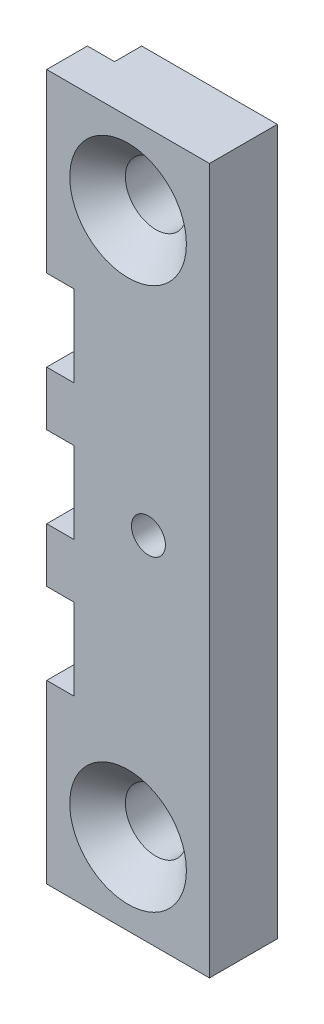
ISO-10303-21;
HEADER;
FILE_DESCRIPTION(('STEP AP214'),'2;1');
FILE_NAME('part.step','',(''),(''),'','','');
FILE_SCHEMA(('AUTOMOTIVE_DESIGN { 1 0 10303 214 1 1 1 1 }'));
ENDSEC;
DATA;
#1=APPLICATION_CONTEXT('core data for automotive mechanical design processes');
#2=APPLICATION_PROTOCOL_DEFINITION('international standard','automotive_design',2000,#1);
#3=PRODUCT_CONTEXT('',#1,'mechanical');
#4=PRODUCT('Part','Part','',(#3));
#5=PRODUCT_RELATED_PRODUCT_CATEGORY('part','',(#4));
#6=PRODUCT_DEFINITION_FORMATION('','',#4);
#7=PRODUCT_DEFINITION_CONTEXT('part definition',#1,'design');
#8=PRODUCT_DEFINITION('design','',#6,#7);
#9=PRODUCT_DEFINITION_SHAPE('','',#8);
#10=(LENGTH_UNIT() NAMED_UNIT(*) SI_UNIT(.MILLI.,.METRE.));
#11=(NAMED_UNIT(*) PLANE_ANGLE_UNIT() SI_UNIT($,.RADIAN.));
#12=(NAMED_UNIT(*) SI_UNIT($,.STERADIAN.) SOLID_ANGLE_UNIT());
#13=UNCERTAINTY_MEASURE_WITH_UNIT(LENGTH_MEASURE(1.E-05),#10,'distance_accuracy_value','');
#14=(GEOMETRIC_REPRESENTATION_CONTEXT(3) GLOBAL_UNCERTAINTY_ASSIGNED_CONTEXT((#13)) GLOBAL_UNIT_ASSIGNED_CONTEXT((#10,
#11,#12)) REPRESENTATION_CONTEXT('',''));
#15=CARTESIAN_POINT('',(0.,0.,0.));
#16=DIRECTION('',(0.,0.,1.));
#17=DIRECTION('',(1.,0.,0.));
#18=AXIS2_PLACEMENT_3D('',#15,#16,#17);
#19=CARTESIAN_POINT('',(0.,0.,5.));
#20=DIRECTION('',(0.,0.,-1.));
#21=DIRECTION('',(-1.,0.,0.));
#22=AXIS2_PLACEMENT_3D('',#19,#20,#21);
#23=PLANE('',#22);
#24=DIRECTION('',(0.,-1.,0.));
#25=VECTOR('',#24,1.);
#26=CARTESIAN_POINT('',(-112.,34.802471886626,5.));
#27=LINE('',#26,#25);
#28=CARTESIAN_POINT('',(-112.,15.802471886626,5.));
#29=VERTEX_POINT('',#28);
#30=CARTESIAN_POINT('',(-112.,11.802471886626,5.));
#31=VERTEX_POINT('',#30);
#32=EDGE_CURVE('E184',#29,#31,#27,.T.);
#33=ORIENTED_EDGE('',*,*,#32,.T.);
#34=DIRECTION('',(1.,0.,0.));
#35=VECTOR('',#34,1.);
#36=CARTESIAN_POINT('',(-114.,11.802471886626,5.));
#37=LINE('',#36,#35);
#38=CARTESIAN_POINT('',(-110.,11.802471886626,5.));
#39=VERTEX_POINT('',#38);
#40=EDGE_CURVE('E259',#31,#39,#37,.T.);
#41=ORIENTED_EDGE('',*,*,#40,.T.);
#42=DIRECTION('',(0.,-1.,0.));
#43=VECTOR('',#42,1.);
#44=CARTESIAN_POINT('',(-110.,11.802471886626,5.));
#45=LINE('',#44,#43);
#46=CARTESIAN_POINT('',(-110.,5.80247188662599,5.));
#47=VERTEX_POINT('',#46);
#48=EDGE_CURVE('E267',#39,#47,#45,.T.);
#49=ORIENTED_EDGE('',*,*,#48,.T.);
#50=DIRECTION('',(-1.,0.,0.));
#51=VECTOR('',#50,1.);
#52=CARTESIAN_POINT('',(-114.,5.80247188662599,5.));
#53=LINE('',#52,#51);
#54=CARTESIAN_POINT('',(-112.,5.80247188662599,5.));
#55=VERTEX_POINT('',#54);
#56=EDGE_CURVE('E264',#47,#55,#53,.T.);
#57=ORIENTED_EDGE('',*,*,#56,.T.);
#58=CARTESIAN_POINT('',(-112.,1.80247188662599,5.));
#59=VERTEX_POINT('',#58);
#60=EDGE_CURVE('E185',#55,#59,#27,.T.);
#61=ORIENTED_EDGE('',*,*,#60,.T.);
#62=DIRECTION('',(1.,0.,0.));
#63=VECTOR('',#62,1.);
#64=CARTESIAN_POINT('',(-112.,1.80247188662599,5.));
#65=LINE('',#64,#63);
#66=CARTESIAN_POINT('',(-110.,1.80247188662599,5.));
#67=VERTEX_POINT('',#66);
#68=EDGE_CURVE('E221',#59,#67,#65,.T.);
#69=ORIENTED_EDGE('',*,*,#68,.T.);
#70=DIRECTION('',(0.,-1.,0.));
#71=VECTOR('',#70,1.);
#72=CARTESIAN_POINT('',(-110.,-4.19752811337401,5.));
#73=LINE('',#72,#71);
#74=CARTESIAN_POINT('',(-110.,-4.19752811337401,5.));
#75=VERTEX_POINT('',#74);
#76=EDGE_CURVE('E225',#67,#75,#73,.T.);
#77=ORIENTED_EDGE('',*,*,#76,.T.);
#78=DIRECTION('',(-1.,0.,0.));
#79=VECTOR('',#78,1.);
#80=CARTESIAN_POINT('',(-112.,-4.19752811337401,5.));
#81=LINE('',#80,#79);
#82=CARTESIAN_POINT('',(-112.,-4.19752811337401,5.));
#83=VERTEX_POINT('',#82);
#84=EDGE_CURVE('E212',#75,#83,#81,.T.);
#85=ORIENTED_EDGE('',*,*,#84,.T.);
#86=CARTESIAN_POINT('',(-112.,-17.197528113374,5.));
#87=VERTEX_POINT('',#86);
#88=EDGE_CURVE('E186',#83,#87,#27,.T.);
#89=ORIENTED_EDGE('',*,*,#88,.T.);
#90=DIRECTION('',(1.,0.,0.));
#91=VECTOR('',#90,1.);
#92=CARTESIAN_POINT('',(-100.,-17.197528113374,5.));
#93=LINE('',#92,#91);
#94=CARTESIAN_POINT('',(-100.,-17.197528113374,5.));
#95=VERTEX_POINT('',#94);
#96=EDGE_CURVE('E163',#87,#95,#93,.T.);
#97=ORIENTED_EDGE('',*,*,#96,.T.);
#98=DIRECTION('',(0.,1.,0.));
#99=VECTOR('',#98,1.);
#100=CARTESIAN_POINT('',(-100.,34.802471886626,5.));
#101=LINE('',#100,#99);
#102=CARTESIAN_POINT('',(-100.,34.802471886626,5.));
#103=VERTEX_POINT('',#102);
#104=EDGE_CURVE('E172',#95,#103,#101,.T.);
#105=ORIENTED_EDGE('',*,*,#104,.T.);
#106=DIRECTION('',(-1.,0.,0.));
#107=VECTOR('',#106,1.);
#108=CARTESIAN_POINT('',(-100.,34.802471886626,5.));
#109=LINE('',#108,#107);
#110=CARTESIAN_POINT('',(-112.,34.802471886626,5.));
#111=VERTEX_POINT('',#110);
#112=EDGE_CURVE('E187',#103,#111,#109,.T.);
#113=ORIENTED_EDGE('',*,*,#112,.T.);
#114=CARTESIAN_POINT('',(-112.,21.802471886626,5.));
#115=VERTEX_POINT('',#114);
#116=EDGE_CURVE('E181',#111,#115,#27,.T.);
#117=ORIENTED_EDGE('',*,*,#116,.T.);
#118=DIRECTION('',(1.,0.,0.));
#119=VECTOR('',#118,1.);
#120=CARTESIAN_POINT('',(-112.,21.802471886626,5.));
#121=LINE('',#120,#119);
#122=CARTESIAN_POINT('',(-110.,21.802471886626,5.));
#123=VERTEX_POINT('',#122);
#124=EDGE_CURVE('E247',#115,#123,#121,.T.);
#125=ORIENTED_EDGE('',*,*,#124,.T.);
#126=DIRECTION('',(0.,-1.,0.));
#127=VECTOR('',#126,1.);
#128=CARTESIAN_POINT('',(-110.,21.802471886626,5.));
#129=LINE('',#128,#127);
#130=CARTESIAN_POINT('',(-110.,15.802471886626,5.));
#131=VERTEX_POINT('',#130);
#132=EDGE_CURVE('E244',#123,#131,#129,.T.);
#133=ORIENTED_EDGE('',*,*,#132,.T.);
#134=DIRECTION('',(-1.,0.,0.));
#135=VECTOR('',#134,1.);
#136=CARTESIAN_POINT('',(-112.,15.802471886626,5.));
#137=LINE('',#136,#135);
#138=EDGE_CURVE('E234',#131,#29,#137,.T.);
#139=ORIENTED_EDGE('',*,*,#138,.T.);
#140=EDGE_LOOP('',(#33,#41,#49,#57,#61,#69,#77,#85,#89,#97,#105,#113,#117,#125,#133,#139));
#141=FACE_BOUND('',#140,.T.);
#142=CARTESIAN_POINT('',(-106.,28.802471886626,5.));
#143=DIRECTION('',(0.,0.,1.));
#144=DIRECTION('',(1.,0.,0.));
#145=AXIS2_PLACEMENT_3D('',#142,#143,#144);
#146=CIRCLE('',#145,4.3);
#147=CARTESIAN_POINT('',(-101.7,28.802471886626,5.));
#148=VERTEX_POINT('',#147);
#149=EDGE_CURVE('E205',#148,#148,#146,.T.);
#150=ORIENTED_EDGE('',*,*,#149,.F.);
#151=EDGE_LOOP('',(#150));
#152=FACE_BOUND('',#151,.T.);
#153=CARTESIAN_POINT('',(-106.,-11.197528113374,5.));
#154=DIRECTION('',(0.,0.,1.));
#155=DIRECTION('',(1.,0.,0.));
#156=AXIS2_PLACEMENT_3D('',#153,#154,#155);
#157=CIRCLE('',#156,4.3);
#158=CARTESIAN_POINT('',(-101.7,-11.197528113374,5.));
#159=VERTEX_POINT('',#158);
#160=EDGE_CURVE('E196',#159,#159,#157,.T.);
#161=ORIENTED_EDGE('',*,*,#160,.F.);
#162=EDGE_LOOP('',(#161));
#163=FACE_BOUND('',#162,.T.);
#164=CARTESIAN_POINT('',(-104.5,8.80247188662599,5.));
#165=DIRECTION('',(0.,0.,1.));
#166=DIRECTION('',(1.,0.,0.));
#167=AXIS2_PLACEMENT_3D('',#164,#165,#166);
#168=CIRCLE('',#167,1.25);
#169=CARTESIAN_POINT('',(-103.25,8.80247188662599,5.));
#170=VERTEX_POINT('',#169);
#171=EDGE_CURVE('E296',#170,#170,#168,.T.);
#172=ORIENTED_EDGE('',*,*,#171,.F.);
#173=EDGE_LOOP('',(#172));
#174=FACE_BOUND('',#173,.T.);
#175=ADVANCED_FACE('F16',(#141,#152,#163,#174),#23,.F.);
#176=CARTESIAN_POINT('',(-112.,34.802471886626,5.));
#177=DIRECTION('',(1.,0.,0.));
#178=DIRECTION('',(0.,0.,-1.));
#179=AXIS2_PLACEMENT_3D('',#176,#177,#178);
#180=PLANE('',#179);
#181=DIRECTION('',(0.,0.,-1.));
#182=VECTOR('',#181,1.);
#183=CARTESIAN_POINT('',(-112.,15.802471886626,5.));
#184=LINE('',#183,#182);
#185=CARTESIAN_POINT('',(-112.,15.802471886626,2.));
#186=VERTEX_POINT('',#185);
#187=EDGE_CURVE('E237',#29,#186,#184,.T.);
#188=ORIENTED_EDGE('',*,*,#187,.T.);
#189=DIRECTION('',(0.,1.,0.));
#190=VECTOR('',#189,1.);
#191=CARTESIAN_POINT('',(-112.,-17.197528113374,2.));
#192=LINE('',#191,#190);
#193=CARTESIAN_POINT('',(-112.,11.802471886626,2.));
#194=VERTEX_POINT('',#193);
#195=EDGE_CURVE('E367',#194,#186,#192,.T.);
#196=ORIENTED_EDGE('',*,*,#195,.F.);
#197=DIRECTION('',(0.,0.,1.));
#198=VECTOR('',#197,1.);
#199=CARTESIAN_POINT('',(-112.,11.802471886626,5.));
#200=LINE('',#199,#198);
#201=EDGE_CURVE('E250',#194,#31,#200,.T.);
#202=ORIENTED_EDGE('',*,*,#201,.T.);
#203=ORIENTED_EDGE('',*,*,#32,.F.);
#204=EDGE_LOOP('',(#188,#196,#202,#203));
#205=FACE_BOUND('',#204,.T.);
#206=ADVANCED_FACE('F303',(#205),#180,.F.);
#207=DIRECTION('',(0.,0.,-1.));
#208=VECTOR('',#207,1.);
#209=CARTESIAN_POINT('',(-112.,34.802471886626,5.));
#210=LINE('',#209,#208);
#211=CARTESIAN_POINT('',(-112.,34.802471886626,2.));
#212=VERTEX_POINT('',#211);
#213=EDGE_CURVE('E24',#111,#212,#210,.T.);
#214=ORIENTED_EDGE('',*,*,#213,.T.);
#215=CARTESIAN_POINT('',(-112.,21.802471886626,2.));
#216=VERTEX_POINT('',#215);
#217=EDGE_CURVE('E160',#216,#212,#192,.T.);
#218=ORIENTED_EDGE('',*,*,#217,.F.);
#219=DIRECTION('',(0.,0.,-1.));
#220=VECTOR('',#219,1.);
#221=CARTESIAN_POINT('',(-112.,21.802471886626,5.));
#222=LINE('',#221,#220);
#223=EDGE_CURVE('E222',#115,#216,#222,.T.);
#224=ORIENTED_EDGE('',*,*,#223,.F.);
#225=ORIENTED_EDGE('',*,*,#116,.F.);
#226=EDGE_LOOP('',(#214,#218,#224,#225));
#227=FACE_BOUND('',#226,.T.);
#228=ADVANCED_FACE('F311',(#227),#180,.F.);
#229=DIRECTION('',(0.,0.,-1.));
#230=VECTOR('',#229,1.);
#231=CARTESIAN_POINT('',(-112.,-4.19752811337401,5.));
#232=LINE('',#231,#230);
#233=CARTESIAN_POINT('',(-112.,-4.19752811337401,2.));
#234=VERTEX_POINT('',#233);
#235=EDGE_CURVE('E157',#83,#234,#232,.T.);
#236=ORIENTED_EDGE('',*,*,#235,.T.);
#237=CARTESIAN_POINT('',(-112.,-17.197528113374,2.));
#238=VERTEX_POINT('',#237);
#239=EDGE_CURVE('E31',#238,#234,#192,.T.);
#240=ORIENTED_EDGE('',*,*,#239,.F.);
#241=DIRECTION('',(0.,0.,-1.));
#242=VECTOR('',#241,1.);
#243=CARTESIAN_POINT('',(-112.,-17.197528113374,5.));
#244=LINE('',#243,#242);
#245=EDGE_CURVE('E155',#87,#238,#244,.T.);
#246=ORIENTED_EDGE('',*,*,#245,.F.);
#247=ORIENTED_EDGE('',*,*,#88,.F.);
#248=EDGE_LOOP('',(#236,#240,#246,#247));
#249=FACE_BOUND('',#248,.T.);
#250=ADVANCED_FACE('F153',(#249),#180,.F.);
#251=CARTESIAN_POINT('',(-100.,34.802471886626,5.));
#252=DIRECTION('',(-1.,0.,0.));
#253=DIRECTION('',(0.,0.,1.));
#254=AXIS2_PLACEMENT_3D('',#251,#252,#253);
#255=PLANE('',#254);
#256=DIRECTION('',(0.,1.,0.));
#257=VECTOR('',#256,1.);
#258=CARTESIAN_POINT('',(-100.,34.802471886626,0.));
#259=LINE('',#258,#257);
#260=CARTESIAN_POINT('',(-100.,-17.197528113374,0.));
#261=VERTEX_POINT('',#260);
#262=CARTESIAN_POINT('',(-100.,34.802471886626,0.));
#263=VERTEX_POINT('',#262);
#264=EDGE_CURVE('E176',#261,#263,#259,.T.);
#265=ORIENTED_EDGE('',*,*,#264,.T.);
#266=DIRECTION('',(0.,0.,-1.));
#267=VECTOR('',#266,1.);
#268=CARTESIAN_POINT('',(-100.,34.802471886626,5.));
#269=LINE('',#268,#267);
#270=EDGE_CURVE('E11',#103,#263,#269,.T.);
#271=ORIENTED_EDGE('',*,*,#270,.F.);
#272=ORIENTED_EDGE('',*,*,#104,.F.);
#273=DIRECTION('',(0.,0.,-1.));
#274=VECTOR('',#273,1.);
#275=CARTESIAN_POINT('',(-100.,-17.197528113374,5.));
#276=LINE('',#275,#274);
#277=EDGE_CURVE('E164',#95,#261,#276,.T.);
#278=ORIENTED_EDGE('',*,*,#277,.T.);
#279=EDGE_LOOP('',(#265,#271,#272,#278));
#280=FACE_BOUND('',#279,.T.);
#281=ADVANCED_FACE('F18',(#280),#255,.F.);
#282=CARTESIAN_POINT('',(-100.,34.802471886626,5.));
#283=DIRECTION('',(0.,-1.,0.));
#284=DIRECTION('',(0.,0.,-1.));
#285=AXIS2_PLACEMENT_3D('',#282,#283,#284);
#286=PLANE('',#285);
#287=DIRECTION('',(-1.,0.,0.));
#288=VECTOR('',#287,1.);
#289=CARTESIAN_POINT('',(-100.,34.802471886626,0.));
#290=LINE('',#289,#288);
#291=CARTESIAN_POINT('',(-110.,34.802471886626,0.));
#292=VERTEX_POINT('',#291);
#293=EDGE_CURVE('E173',#263,#292,#290,.T.);
#294=ORIENTED_EDGE('',*,*,#293,.T.);
#295=DIRECTION('',(0.,0.,-1.));
#296=VECTOR('',#295,1.);
#297=CARTESIAN_POINT('',(-110.,34.802471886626,0.));
#298=LINE('',#297,#296);
#299=CARTESIAN_POINT('',(-110.,34.802471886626,2.));
#300=VERTEX_POINT('',#299);
#301=EDGE_CURVE('E148',#300,#292,#298,.T.);
#302=ORIENTED_EDGE('',*,*,#301,.F.);
#303=DIRECTION('',(1.,0.,0.));
#304=VECTOR('',#303,1.);
#305=CARTESIAN_POINT('',(-112.,34.802471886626,2.));
#306=LINE('',#305,#304);
#307=EDGE_CURVE('E290',#212,#300,#306,.T.);
#308=ORIENTED_EDGE('',*,*,#307,.F.);
#309=ORIENTED_EDGE('',*,*,#213,.F.);
#310=ORIENTED_EDGE('',*,*,#112,.F.);
#311=ORIENTED_EDGE('',*,*,#270,.T.);
#312=EDGE_LOOP('',(#294,#302,#308,#309,#310,#311));
#313=FACE_BOUND('',#312,.T.);
#314=ADVANCED_FACE('F327',(#313),#286,.F.);
#315=DIRECTION('',(0.,0.,-1.));
#316=VECTOR('',#315,1.);
#317=CARTESIAN_POINT('',(-112.,5.802471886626,5.));
#318=LINE('',#317,#316);
#319=CARTESIAN_POINT('',(-112.,5.802471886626,2.));
#320=VERTEX_POINT('',#319);
#321=EDGE_CURVE('E252',#55,#320,#318,.T.);
#322=ORIENTED_EDGE('',*,*,#321,.T.);
#323=CARTESIAN_POINT('',(-112.,1.80247188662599,2.));
#324=VERTEX_POINT('',#323);
#325=EDGE_CURVE('E158',#324,#320,#192,.T.);
#326=ORIENTED_EDGE('',*,*,#325,.F.);
#327=DIRECTION('',(0.,0.,-1.));
#328=VECTOR('',#327,1.);
#329=CARTESIAN_POINT('',(-112.,1.80247188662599,5.));
#330=LINE('',#329,#328);
#331=EDGE_CURVE('E208',#59,#324,#330,.T.);
#332=ORIENTED_EDGE('',*,*,#331,.F.);
#333=ORIENTED_EDGE('',*,*,#60,.F.);
#334=EDGE_LOOP('',(#322,#326,#332,#333));
#335=FACE_BOUND('',#334,.T.);
#336=ADVANCED_FACE('F314',(#335),#180,.F.);
#337=CARTESIAN_POINT('',(-100.,-17.197528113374,5.));
#338=DIRECTION('',(0.,1.,0.));
#339=DIRECTION('',(0.,0.,1.));
#340=AXIS2_PLACEMENT_3D('',#337,#338,#339);
#341=PLANE('',#340);
#342=DIRECTION('',(1.,0.,0.));
#343=VECTOR('',#342,1.);
#344=CARTESIAN_POINT('',(-112.,-17.197528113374,2.));
#345=LINE('',#344,#343);
#346=CARTESIAN_POINT('',(-110.,-17.197528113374,2.));
#347=VERTEX_POINT('',#346);
#348=EDGE_CURVE('E139',#238,#347,#345,.T.);
#349=ORIENTED_EDGE('',*,*,#348,.T.);
#350=DIRECTION('',(0.,0.,-1.));
#351=VECTOR('',#350,1.);
#352=CARTESIAN_POINT('',(-110.,-17.197528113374,0.));
#353=LINE('',#352,#351);
#354=CARTESIAN_POINT('',(-110.,-17.197528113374,0.));
#355=VERTEX_POINT('',#354);
#356=EDGE_CURVE('E147',#347,#355,#353,.T.);
#357=ORIENTED_EDGE('',*,*,#356,.T.);
#358=DIRECTION('',(1.,0.,0.));
#359=VECTOR('',#358,1.);
#360=CARTESIAN_POINT('',(-100.,-17.197528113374,0.));
#361=LINE('',#360,#359);
#362=EDGE_CURVE('E170',#355,#261,#361,.T.);
#363=ORIENTED_EDGE('',*,*,#362,.T.);
#364=ORIENTED_EDGE('',*,*,#277,.F.);
#365=ORIENTED_EDGE('',*,*,#96,.F.);
#366=ORIENTED_EDGE('',*,*,#245,.T.);
#367=EDGE_LOOP('',(#349,#357,#363,#364,#365,#366));
#368=FACE_BOUND('',#367,.T.);
#369=ADVANCED_FACE('F161',(#368),#341,.F.);
#370=CARTESIAN_POINT('',(0.,0.,0.));
#371=DIRECTION('',(0.,0.,-1.));
#372=DIRECTION('',(-1.,0.,0.));
#373=AXIS2_PLACEMENT_3D('',#370,#371,#372);
#374=PLANE('',#373);
#375=CARTESIAN_POINT('',(-104.5,8.80247188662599,0.));
#376=DIRECTION('',(0.,0.,1.));
#377=DIRECTION('',(1.,0.,0.));
#378=AXIS2_PLACEMENT_3D('',#375,#376,#377);
#379=CIRCLE('',#378,1.25);
#380=CARTESIAN_POINT('',(-103.25,8.80247188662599,0.));
#381=VERTEX_POINT('',#380);
#382=EDGE_CURVE('E292',#381,#381,#379,.T.);
#383=ORIENTED_EDGE('',*,*,#382,.T.);
#384=EDGE_LOOP('',(#383));
#385=FACE_BOUND('',#384,.T.);
#386=DIRECTION('',(0.,-1.,0.));
#387=VECTOR('',#386,1.);
#388=CARTESIAN_POINT('',(-110.,-4.19752811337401,0.));
#389=LINE('',#388,#387);
#390=EDGE_CURVE('E219',#292,#355,#389,.T.);
#391=ORIENTED_EDGE('',*,*,#390,.F.);
#392=ORIENTED_EDGE('',*,*,#293,.F.);
#393=ORIENTED_EDGE('',*,*,#264,.F.);
#394=ORIENTED_EDGE('',*,*,#362,.F.);
#395=EDGE_LOOP('',(#391,#392,#393,#394));
#396=FACE_BOUND('',#395,.T.);
#397=CARTESIAN_POINT('',(-106.,28.802471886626,0.));
#398=DIRECTION('',(0.,0.,1.));
#399=DIRECTION('',(1.,0.,0.));
#400=AXIS2_PLACEMENT_3D('',#397,#398,#399);
#401=CIRCLE('',#400,2.25);
#402=CARTESIAN_POINT('',(-103.75,28.802471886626,0.));
#403=VERTEX_POINT('',#402);
#404=EDGE_CURVE('E199',#403,#403,#401,.T.);
#405=ORIENTED_EDGE('',*,*,#404,.T.);
#406=EDGE_LOOP('',(#405));
#407=FACE_BOUND('',#406,.T.);
#408=CARTESIAN_POINT('',(-106.,-11.197528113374,0.));
#409=DIRECTION('',(0.,0.,1.));
#410=DIRECTION('',(1.,0.,0.));
#411=AXIS2_PLACEMENT_3D('',#408,#409,#410);
#412=CIRCLE('',#411,2.25);
#413=CARTESIAN_POINT('',(-103.75,-11.197528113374,0.));
#414=VERTEX_POINT('',#413);
#415=EDGE_CURVE('E179',#414,#414,#412,.T.);
#416=ORIENTED_EDGE('',*,*,#415,.T.);
#417=EDGE_LOOP('',(#416));
#418=FACE_BOUND('',#417,.T.);
#419=ADVANCED_FACE('F321',(#385,#396,#407,#418),#374,.T.);
#420=CARTESIAN_POINT('',(-106.,-11.197528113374,5.));
#421=DIRECTION('',(0.,0.,1.));
#422=DIRECTION('',(1.,0.,0.));
#423=AXIS2_PLACEMENT_3D('',#420,#421,#422);
#424=CYLINDRICAL_SURFACE('',#423,2.25);
#425=ORIENTED_EDGE('',*,*,#415,.F.);
#426=EDGE_LOOP('',(#425));
#427=FACE_BOUND('',#426,.T.);
#428=CARTESIAN_POINT('',(-106.,-11.197528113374,2.95));
#429=DIRECTION('',(0.,0.,1.));
#430=DIRECTION('',(1.,0.,0.));
#431=AXIS2_PLACEMENT_3D('',#428,#429,#430);
#432=CIRCLE('',#431,2.25);
#433=CARTESIAN_POINT('',(-103.75,-11.197528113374,2.95));
#434=VERTEX_POINT('',#433);
#435=EDGE_CURVE('E193',#434,#434,#432,.T.);
#436=ORIENTED_EDGE('',*,*,#435,.T.);
#437=EDGE_LOOP('',(#436));
#438=FACE_BOUND('',#437,.T.);
#439=ADVANCED_FACE('F319',(#427,#438),#424,.F.);
#440=CARTESIAN_POINT('',(-106.,-11.197528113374,5.));
#441=DIRECTION('',(0.,0.,1.));
#442=DIRECTION('',(1.,0.,0.));
#443=AXIS2_PLACEMENT_3D('',#440,#441,#442);
#444=CONICAL_SURFACE('',#443,4.3,0.785398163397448);
#445=ORIENTED_EDGE('',*,*,#435,.F.);
#446=EDGE_LOOP('',(#445));
#447=FACE_BOUND('',#446,.T.);
#448=ORIENTED_EDGE('',*,*,#160,.T.);
#449=EDGE_LOOP('',(#448));
#450=FACE_BOUND('',#449,.T.);
#451=ADVANCED_FACE('F412',(#447,#450),#444,.F.);
#452=CARTESIAN_POINT('',(-106.,28.802471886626,5.));
#453=DIRECTION('',(0.,0.,1.));
#454=DIRECTION('',(1.,0.,0.));
#455=AXIS2_PLACEMENT_3D('',#452,#453,#454);
#456=CYLINDRICAL_SURFACE('',#455,2.25);
#457=ORIENTED_EDGE('',*,*,#404,.F.);
#458=EDGE_LOOP('',(#457));
#459=FACE_BOUND('',#458,.T.);
#460=CARTESIAN_POINT('',(-106.,28.802471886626,2.95));
#461=DIRECTION('',(0.,0.,1.));
#462=DIRECTION('',(1.,0.,0.));
#463=AXIS2_PLACEMENT_3D('',#460,#461,#462);
#464=CIRCLE('',#463,2.25);
#465=CARTESIAN_POINT('',(-103.75,28.802471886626,2.95));
#466=VERTEX_POINT('',#465);
#467=EDGE_CURVE('E202',#466,#466,#464,.T.);
#468=ORIENTED_EDGE('',*,*,#467,.T.);
#469=EDGE_LOOP('',(#468));
#470=FACE_BOUND('',#469,.T.);
#471=ADVANCED_FACE('F409',(#459,#470),#456,.F.);
#472=CARTESIAN_POINT('',(-106.,28.802471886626,5.));
#473=DIRECTION('',(0.,0.,1.));
#474=DIRECTION('',(1.,0.,0.));
#475=AXIS2_PLACEMENT_3D('',#472,#473,#474);
#476=CONICAL_SURFACE('',#475,4.3,0.785398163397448);
#477=ORIENTED_EDGE('',*,*,#467,.F.);
#478=EDGE_LOOP('',(#477));
#479=FACE_BOUND('',#478,.T.);
#480=ORIENTED_EDGE('',*,*,#149,.T.);
#481=EDGE_LOOP('',(#480));
#482=FACE_BOUND('',#481,.T.);
#483=ADVANCED_FACE('F402',(#479,#482),#476,.F.);
#484=CARTESIAN_POINT('',(-112.,-4.19752811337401,5.));
#485=DIRECTION('',(0.,-1.,0.));
#486=DIRECTION('',(0.,0.,-1.));
#487=AXIS2_PLACEMENT_3D('',#484,#485,#486);
#488=PLANE('',#487);
#489=DIRECTION('',(0.,0.,-1.));
#490=VECTOR('',#489,1.);
#491=CARTESIAN_POINT('',(-110.,-4.19752811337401,5.));
#492=LINE('',#491,#490);
#493=CARTESIAN_POINT('',(-110.,-4.19752811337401,2.));
#494=VERTEX_POINT('',#493);
#495=EDGE_CURVE('E215',#75,#494,#492,.T.);
#496=ORIENTED_EDGE('',*,*,#495,.T.);
#497=DIRECTION('',(-1.,0.,0.));
#498=VECTOR('',#497,1.);
#499=CARTESIAN_POINT('',(-112.,-4.19752811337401,2.));
#500=LINE('',#499,#498);
#501=EDGE_CURVE('E270',#494,#234,#500,.T.);
#502=ORIENTED_EDGE('',*,*,#501,.T.);
#503=ORIENTED_EDGE('',*,*,#235,.F.);
#504=ORIENTED_EDGE('',*,*,#84,.F.);
#505=EDGE_LOOP('',(#496,#502,#503,#504));
#506=FACE_BOUND('',#505,.T.);
#507=ADVANCED_FACE('F357',(#506),#488,.F.);
#508=CARTESIAN_POINT('',(-110.,-4.19752811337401,5.));
#509=DIRECTION('',(1.,0.,0.));
#510=DIRECTION('',(0.,0.,-1.));
#511=AXIS2_PLACEMENT_3D('',#508,#509,#510);
#512=PLANE('',#511);
#513=DIRECTION('',(0.,0.,-1.));
#514=VECTOR('',#513,1.);
#515=CARTESIAN_POINT('',(-110.,1.80247188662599,5.));
#516=LINE('',#515,#514);
#517=CARTESIAN_POINT('',(-110.,1.80247188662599,2.));
#518=VERTEX_POINT('',#517);
#519=EDGE_CURVE('E211',#67,#518,#516,.T.);
#520=ORIENTED_EDGE('',*,*,#519,.T.);
#521=DIRECTION('',(0.,1.,0.));
#522=VECTOR('',#521,1.);
#523=CARTESIAN_POINT('',(-110.,-17.197528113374,2.));
#524=LINE('',#523,#522);
#525=CARTESIAN_POINT('',(-110.,5.80247188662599,2.));
#526=VERTEX_POINT('',#525);
#527=EDGE_CURVE('E287',#518,#526,#524,.T.);
#528=ORIENTED_EDGE('',*,*,#527,.T.);
#529=DIRECTION('',(0.,0.,-1.));
#530=VECTOR('',#529,1.);
#531=CARTESIAN_POINT('',(-110.,5.80247188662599,5.));
#532=LINE('',#531,#530);
#533=EDGE_CURVE('E256',#47,#526,#532,.T.);
#534=ORIENTED_EDGE('',*,*,#533,.F.);
#535=ORIENTED_EDGE('',*,*,#48,.F.);
#536=DIRECTION('',(0.,0.,-1.));
#537=VECTOR('',#536,1.);
#538=CARTESIAN_POINT('',(-110.,11.802471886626,5.));
#539=LINE('',#538,#537);
#540=CARTESIAN_POINT('',(-110.,11.802471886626,2.));
#541=VERTEX_POINT('',#540);
#542=EDGE_CURVE('E255',#39,#541,#539,.T.);
#543=ORIENTED_EDGE('',*,*,#542,.T.);
#544=CARTESIAN_POINT('',(-110.,15.802471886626,2.));
#545=VERTEX_POINT('',#544);
#546=EDGE_CURVE('E346',#541,#545,#524,.T.);
#547=ORIENTED_EDGE('',*,*,#546,.T.);
#548=DIRECTION('',(0.,0.,-1.));
#549=VECTOR('',#548,1.);
#550=CARTESIAN_POINT('',(-110.,15.802471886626,5.));
#551=LINE('',#550,#549);
#552=EDGE_CURVE('E233',#131,#545,#551,.T.);
#553=ORIENTED_EDGE('',*,*,#552,.F.);
#554=ORIENTED_EDGE('',*,*,#132,.F.);
#555=DIRECTION('',(0.,0.,-1.));
#556=VECTOR('',#555,1.);
#557=CARTESIAN_POINT('',(-110.,21.802471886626,5.));
#558=LINE('',#557,#556);
#559=CARTESIAN_POINT('',(-110.,21.802471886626,2.));
#560=VERTEX_POINT('',#559);
#561=EDGE_CURVE('E230',#123,#560,#558,.T.);
#562=ORIENTED_EDGE('',*,*,#561,.T.);
#563=EDGE_CURVE('E39',#560,#300,#524,.T.);
#564=ORIENTED_EDGE('',*,*,#563,.T.);
#565=ORIENTED_EDGE('',*,*,#301,.T.);
#566=ORIENTED_EDGE('',*,*,#390,.T.);
#567=ORIENTED_EDGE('',*,*,#356,.F.);
#568=EDGE_CURVE('E142',#347,#494,#524,.T.);
#569=ORIENTED_EDGE('',*,*,#568,.T.);
#570=ORIENTED_EDGE('',*,*,#495,.F.);
#571=ORIENTED_EDGE('',*,*,#76,.F.);
#572=EDGE_LOOP('',(#520,#528,#534,#535,#543,#547,#553,#554,#562,#564,#565,#566,#567,#569,#570,#571));
#573=FACE_BOUND('',#572,.T.);
#574=ADVANCED_FACE('F344',(#573),#512,.F.);
#575=CARTESIAN_POINT('',(-112.,1.80247188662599,5.));
#576=DIRECTION('',(0.,1.,0.));
#577=DIRECTION('',(0.,0.,1.));
#578=AXIS2_PLACEMENT_3D('',#575,#576,#577);
#579=PLANE('',#578);
#580=ORIENTED_EDGE('',*,*,#331,.T.);
#581=DIRECTION('',(1.,0.,0.));
#582=VECTOR('',#581,1.);
#583=CARTESIAN_POINT('',(-112.,1.80247188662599,2.));
#584=LINE('',#583,#582);
#585=EDGE_CURVE('E272',#324,#518,#584,.T.);
#586=ORIENTED_EDGE('',*,*,#585,.T.);
#587=ORIENTED_EDGE('',*,*,#519,.F.);
#588=ORIENTED_EDGE('',*,*,#68,.F.);
#589=EDGE_LOOP('',(#580,#586,#587,#588));
#590=FACE_BOUND('',#589,.T.);
#591=ADVANCED_FACE('F361',(#590),#579,.F.);
#592=CARTESIAN_POINT('',(-112.,21.802471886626,5.));
#593=DIRECTION('',(0.,1.,0.));
#594=DIRECTION('',(0.,0.,1.));
#595=AXIS2_PLACEMENT_3D('',#592,#593,#594);
#596=PLANE('',#595);
#597=ORIENTED_EDGE('',*,*,#223,.T.);
#598=DIRECTION('',(1.,0.,0.));
#599=VECTOR('',#598,1.);
#600=CARTESIAN_POINT('',(-112.,21.802471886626,2.));
#601=LINE('',#600,#599);
#602=EDGE_CURVE('E275',#216,#560,#601,.T.);
#603=ORIENTED_EDGE('',*,*,#602,.T.);
#604=ORIENTED_EDGE('',*,*,#561,.F.);
#605=ORIENTED_EDGE('',*,*,#124,.F.);
#606=EDGE_LOOP('',(#597,#603,#604,#605));
#607=FACE_BOUND('',#606,.T.);
#608=ADVANCED_FACE('F392',(#607),#596,.F.);
#609=CARTESIAN_POINT('',(-112.,15.802471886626,5.));
#610=DIRECTION('',(0.,-1.,0.));
#611=DIRECTION('',(0.,0.,-1.));
#612=AXIS2_PLACEMENT_3D('',#609,#610,#611);
#613=PLANE('',#612);
#614=ORIENTED_EDGE('',*,*,#552,.T.);
#615=DIRECTION('',(-1.,0.,0.));
#616=VECTOR('',#615,1.);
#617=CARTESIAN_POINT('',(-112.,15.802471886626,2.));
#618=LINE('',#617,#616);
#619=EDGE_CURVE('E277',#545,#186,#618,.T.);
#620=ORIENTED_EDGE('',*,*,#619,.T.);
#621=ORIENTED_EDGE('',*,*,#187,.F.);
#622=ORIENTED_EDGE('',*,*,#138,.F.);
#623=EDGE_LOOP('',(#614,#620,#621,#622));
#624=FACE_BOUND('',#623,.T.);
#625=ADVANCED_FACE('F374',(#624),#613,.F.);
#626=CARTESIAN_POINT('',(-114.,11.802471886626,5.));
#627=DIRECTION('',(0.,1.,0.));
#628=DIRECTION('',(0.,0.,1.));
#629=AXIS2_PLACEMENT_3D('',#626,#627,#628);
#630=PLANE('',#629);
#631=ORIENTED_EDGE('',*,*,#201,.F.);
#632=DIRECTION('',(1.,0.,0.));
#633=VECTOR('',#632,1.);
#634=CARTESIAN_POINT('',(-114.,11.802471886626,2.));
#635=LINE('',#634,#633);
#636=EDGE_CURVE('E280',#194,#541,#635,.T.);
#637=ORIENTED_EDGE('',*,*,#636,.T.);
#638=ORIENTED_EDGE('',*,*,#542,.F.);
#639=ORIENTED_EDGE('',*,*,#40,.F.);
#640=EDGE_LOOP('',(#631,#637,#638,#639));
#641=FACE_BOUND('',#640,.T.);
#642=ADVANCED_FACE('F383',(#641),#630,.F.);
#643=CARTESIAN_POINT('',(-114.,5.80247188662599,5.));
#644=DIRECTION('',(0.,-1.,0.));
#645=DIRECTION('',(1.,0.,0.));
#646=AXIS2_PLACEMENT_3D('',#643,#644,#645);
#647=PLANE('',#646);
#648=ORIENTED_EDGE('',*,*,#533,.T.);
#649=DIRECTION('',(-1.,0.,0.));
#650=VECTOR('',#649,1.);
#651=CARTESIAN_POINT('',(-114.,5.80247188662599,2.));
#652=LINE('',#651,#650);
#653=EDGE_CURVE('E283',#526,#320,#652,.T.);
#654=ORIENTED_EDGE('',*,*,#653,.T.);
#655=ORIENTED_EDGE('',*,*,#321,.F.);
#656=ORIENTED_EDGE('',*,*,#56,.F.);
#657=EDGE_LOOP('',(#648,#654,#655,#656));
#658=FACE_BOUND('',#657,.T.);
#659=ADVANCED_FACE('F381',(#658),#647,.F.);
#660=CARTESIAN_POINT('',(-112.,-17.197528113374,2.));
#661=DIRECTION('',(0.,0.,1.));
#662=DIRECTION('',(1.,0.,0.));
#663=AXIS2_PLACEMENT_3D('',#660,#661,#662);
#664=PLANE('',#663);
#665=ORIENTED_EDGE('',*,*,#325,.T.);
#666=ORIENTED_EDGE('',*,*,#653,.F.);
#667=ORIENTED_EDGE('',*,*,#527,.F.);
#668=ORIENTED_EDGE('',*,*,#585,.F.);
#669=EDGE_LOOP('',(#665,#666,#667,#668));
#670=FACE_BOUND('',#669,.T.);
#671=ADVANCED_FACE('F365',(#670),#664,.F.);
#672=ORIENTED_EDGE('',*,*,#546,.F.);
#673=ORIENTED_EDGE('',*,*,#636,.F.);
#674=ORIENTED_EDGE('',*,*,#195,.T.);
#675=ORIENTED_EDGE('',*,*,#619,.F.);
#676=EDGE_LOOP('',(#672,#673,#674,#675));
#677=FACE_BOUND('',#676,.T.);
#678=ADVANCED_FACE('F370',(#677),#664,.F.);
#679=ORIENTED_EDGE('',*,*,#217,.T.);
#680=ORIENTED_EDGE('',*,*,#307,.T.);
#681=ORIENTED_EDGE('',*,*,#563,.F.);
#682=ORIENTED_EDGE('',*,*,#602,.F.);
#683=EDGE_LOOP('',(#679,#680,#681,#682));
#684=FACE_BOUND('',#683,.T.);
#685=ADVANCED_FACE('F347',(#684),#664,.F.);
#686=ORIENTED_EDGE('',*,*,#568,.F.);
#687=ORIENTED_EDGE('',*,*,#348,.F.);
#688=ORIENTED_EDGE('',*,*,#239,.T.);
#689=ORIENTED_EDGE('',*,*,#501,.F.);
#690=EDGE_LOOP('',(#686,#687,#688,#689));
#691=FACE_BOUND('',#690,.T.);
#692=ADVANCED_FACE('F140',(#691),#664,.F.);
#693=CARTESIAN_POINT('',(-104.5,8.80247188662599,5.));
#694=DIRECTION('',(0.,0.,1.));
#695=DIRECTION('',(1.,0.,0.));
#696=AXIS2_PLACEMENT_3D('',#693,#694,#695);
#697=CYLINDRICAL_SURFACE('',#696,1.25);
#698=ORIENTED_EDGE('',*,*,#382,.F.);
#699=EDGE_LOOP('',(#698));
#700=FACE_BOUND('',#699,.T.);
#701=ORIENTED_EDGE('',*,*,#171,.T.);
#702=EDGE_LOOP('',(#701));
#703=FACE_BOUND('',#702,.T.);
#704=ADVANCED_FACE('F300',(#700,#703),#697,.F.);
#705=CLOSED_SHELL('',(#175,#206,#228,#250,#281,#314,#336,#369,#419,#439,#451,#471,#483,#507,
#574,#591,#608,#625,#642,#659,#671,#678,#685,#692,#704));
#706=MANIFOLD_SOLID_BREP('B1',#705);
#707=ADVANCED_BREP_SHAPE_REPRESENTATION('',(#18,#706),#14);
#708=SHAPE_DEFINITION_REPRESENTATION(#9,#707);
ENDSEC;
END-ISO-10303-21;
